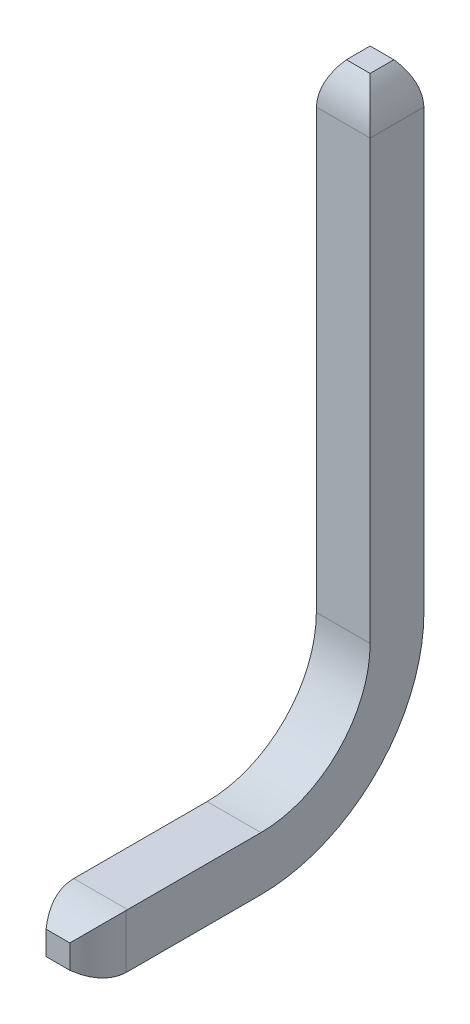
ISO-10303-21;
HEADER;
FILE_DESCRIPTION(('STEP AP214'),'2;1');
FILE_NAME('part.step','',(''),(''),'','','');
FILE_SCHEMA(('AUTOMOTIVE_DESIGN { 1 0 10303 214 1 1 1 1 }'));
ENDSEC;
DATA;
#1=APPLICATION_CONTEXT('core data for automotive mechanical design processes');
#2=APPLICATION_PROTOCOL_DEFINITION('international standard','automotive_design',2000,#1);
#3=PRODUCT_CONTEXT('',#1,'mechanical');
#4=PRODUCT('Part','Part','',(#3));
#5=PRODUCT_RELATED_PRODUCT_CATEGORY('part','',(#4));
#6=PRODUCT_DEFINITION_FORMATION('','',#4);
#7=PRODUCT_DEFINITION_CONTEXT('part definition',#1,'design');
#8=PRODUCT_DEFINITION('design','',#6,#7);
#9=PRODUCT_DEFINITION_SHAPE('','',#8);
#10=(LENGTH_UNIT() NAMED_UNIT(*) SI_UNIT(.MILLI.,.METRE.));
#11=(NAMED_UNIT(*) PLANE_ANGLE_UNIT() SI_UNIT($,.RADIAN.));
#12=(NAMED_UNIT(*) SI_UNIT($,.STERADIAN.) SOLID_ANGLE_UNIT());
#13=UNCERTAINTY_MEASURE_WITH_UNIT(LENGTH_MEASURE(1.E-05),#10,'distance_accuracy_value','');
#14=(GEOMETRIC_REPRESENTATION_CONTEXT(3) GLOBAL_UNCERTAINTY_ASSIGNED_CONTEXT((#13)) GLOBAL_UNIT_ASSIGNED_CONTEXT((#10,
#11,#12)) REPRESENTATION_CONTEXT('',''));
#15=CARTESIAN_POINT('',(0.,0.,0.));
#16=DIRECTION('',(0.,0.,1.));
#17=DIRECTION('',(1.,0.,0.));
#18=AXIS2_PLACEMENT_3D('',#15,#16,#17);
#19=CARTESIAN_POINT('',(0.384591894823,0.144833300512,2.506287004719));
#20=DIRECTION('',(0.,-1.,0.));
#21=DIRECTION('',(0.,0.,-1.));
#22=AXIS2_PLACEMENT_3D('',#19,#20,#21);
#23=CYLINDRICAL_SURFACE('',#22,0.635);
#24=CARTESIAN_POINT('',(-0.250190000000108,0.144622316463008,2.522928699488));
#25=CARTESIAN_POINT('',(-0.24981277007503,0.144251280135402,2.53739312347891));
#26=CARTESIAN_POINT('',(-0.248937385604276,0.143382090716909,2.55182184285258));
#27=CARTESIAN_POINT('',(-0.246222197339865,0.140679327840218,2.58048452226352));
#28=CARTESIAN_POINT('',(-0.244383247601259,0.138846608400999,2.59471864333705));
#29=CARTESIAN_POINT('',(-0.237513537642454,0.131995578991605,2.63669503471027));
#30=CARTESIAN_POINT('',(-0.231120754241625,0.125615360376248,2.66401099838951));
#31=CARTESIAN_POINT('',(-0.215201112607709,0.109721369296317,2.7165928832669));
#32=CARTESIAN_POINT('',(-0.205684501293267,0.100217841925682,2.74186517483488));
#33=CARTESIAN_POINT('',(-0.184043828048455,0.0786043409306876,2.79015344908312));
#34=CARTESIAN_POINT('',(-0.171912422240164,0.0664870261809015,2.8131628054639));
#35=CARTESIAN_POINT('',(-0.15129887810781,0.0458967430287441,2.8472483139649));
#36=CARTESIAN_POINT('',(-0.143507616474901,0.0381141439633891,2.85918161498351));
#37=CARTESIAN_POINT('',(-0.127388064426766,0.0220124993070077,2.88218228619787));
#38=CARTESIAN_POINT('',(-0.119062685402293,0.0136963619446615,2.89325372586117));
#39=CARTESIAN_POINT('',(-0.110489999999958,0.00513330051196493,2.90392869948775));
#40=B_SPLINE_CURVE_WITH_KNOTS('',3,(#24,#25,#26,#27,#28,#29,#30,#31,#32,#33,#34,#35,#36,#37,#38,
#39),.UNSPECIFIED.,.F.,.F.,(4,2,2,2,2,2,2,4),(0.,0.0433870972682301,0.0867358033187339,
0.172547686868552,0.258080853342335,0.343857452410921,0.392536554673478,0.440969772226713),.UNSPECIFIED.);
#41=CARTESIAN_POINT('',(-0.250189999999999,0.144622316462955,2.52292869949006));
#42=VERTEX_POINT('',#41);
#43=CARTESIAN_POINT('',(-0.110489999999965,0.00513330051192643,2.9039286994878));
#44=VERTEX_POINT('',#43);
#45=EDGE_CURVE('E136',#42,#44,#40,.T.);
#46=ORIENTED_EDGE('',*,*,#45,.F.);
#47=DIRECTION('',(0.,1.,0.));
#48=VECTOR('',#47,1.);
#49=CARTESIAN_POINT('',(-0.250189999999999,0.144833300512,2.522928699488));
#50=LINE('',#49,#48);
#51=CARTESIAN_POINT('',(-0.250190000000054,-0.355335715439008,2.522928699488));
#52=VERTEX_POINT('',#51);
#53=EDGE_CURVE('E135',#42,#52,#50,.F.);
#54=ORIENTED_EDGE('',*,*,#53,.T.);
#55=CARTESIAN_POINT('',(-0.110489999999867,-0.215846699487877,2.9039286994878));
#56=CARTESIAN_POINT('',(-0.127635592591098,-0.23297308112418,2.88259789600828));
#57=CARTESIAN_POINT('',(-0.143837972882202,-0.249157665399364,2.85958018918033));
#58=CARTESIAN_POINT('',(-0.173789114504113,-0.279074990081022,2.81006473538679));
#59=CARTESIAN_POINT('',(-0.187504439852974,-0.292774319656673,2.78352684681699));
#60=CARTESIAN_POINT('',(-0.211535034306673,-0.316773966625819,2.72719819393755));
#61=CARTESIAN_POINT('',(-0.221823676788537,-0.327047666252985,2.69738424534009));
#62=CARTESIAN_POINT('',(-0.237911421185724,-0.34310624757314,2.6355934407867));
#63=CARTESIAN_POINT('',(-0.243743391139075,-0.348923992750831,2.60363434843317));
#64=CARTESIAN_POINT('',(-0.247902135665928,-0.353065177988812,2.56322667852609));
#65=CARTESIAN_POINT('',(-0.248573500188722,-0.353733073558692,2.5551965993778));
#66=CARTESIAN_POINT('',(-0.249611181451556,-0.354763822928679,2.5390912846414));
#67=CARTESIAN_POINT('',(-0.24997727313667,-0.355126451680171,2.53101602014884));
#68=CARTESIAN_POINT('',(-0.250190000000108,-0.355335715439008,2.522928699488));
#69=B_SPLINE_CURVE_WITH_KNOTS('',3,(#55,#56,#57,#58,#59,#60,#61,#62,#63,#64,#65,#66,#67,#68),
.UNSPECIFIED.,.F.,.F.,(4,2,2,2,2,2,4),(0.,0.0969606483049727,0.195141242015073,
0.294067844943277,0.392257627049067,0.416507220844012,0.440774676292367),.UNSPECIFIED.);
#70=CARTESIAN_POINT('',(-0.110489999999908,-0.215846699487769,2.90392869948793));
#71=VERTEX_POINT('',#70);
#72=EDGE_CURVE('E21',#71,#52,#69,.T.);
#73=ORIENTED_EDGE('',*,*,#72,.F.);
#74=DIRECTION('',(0.,-1.,0.));
#75=VECTOR('',#74,1.);
#76=CARTESIAN_POINT('',(-0.11049,0.144833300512,2.903928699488));
#77=LINE('',#76,#75);
#78=EDGE_CURVE('E120',#44,#71,#77,.T.);
#79=ORIENTED_EDGE('',*,*,#78,.F.);
#80=EDGE_LOOP('',(#46,#54,#73,#79));
#81=FACE_BOUND('',#80,.T.);
#82=ADVANCED_FACE('F17',(#81),#23,.T.);
#83=CARTESIAN_POINT('',(0.25019,0.144833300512,2.903928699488));
#84=DIRECTION('',(0.,0.,1.));
#85=DIRECTION('',(0.,-1.,0.));
#86=AXIS2_PLACEMENT_3D('',#83,#84,#85);
#87=PLANE('',#86);
#88=DIRECTION('',(1.,0.,0.));
#89=VECTOR('',#88,1.);
#90=CARTESIAN_POINT('',(-0.25019,0.00513330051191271,2.90392869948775));
#91=LINE('',#90,#89);
#92=CARTESIAN_POINT('',(0.110489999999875,0.00513330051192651,2.90392869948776));
#93=VERTEX_POINT('',#92);
#94=EDGE_CURVE('E157',#44,#93,#91,.T.);
#95=ORIENTED_EDGE('',*,*,#94,.F.);
#96=ORIENTED_EDGE('',*,*,#78,.T.);
#97=DIRECTION('',(1.,0.,0.));
#98=VECTOR('',#97,1.);
#99=CARTESIAN_POINT('',(-0.25019,-0.215846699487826,2.90392869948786));
#100=LINE('',#99,#98);
#101=CARTESIAN_POINT('',(0.110489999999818,-0.215846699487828,2.90392869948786));
#102=VERTEX_POINT('',#101);
#103=EDGE_CURVE('E132',#102,#71,#100,.F.);
#104=ORIENTED_EDGE('',*,*,#103,.F.);
#105=DIRECTION('',(0.,-1.,0.));
#106=VECTOR('',#105,1.);
#107=CARTESIAN_POINT('',(0.110489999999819,0.144833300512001,2.90392869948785));
#108=LINE('',#107,#106);
#109=EDGE_CURVE('E180',#93,#102,#108,.T.);
#110=ORIENTED_EDGE('',*,*,#109,.F.);
#111=EDGE_LOOP('',(#95,#96,#104,#110));
#112=FACE_BOUND('',#111,.T.);
#113=ADVANCED_FACE('F294',(#112),#87,.T.);
#114=CARTESIAN_POINT('',(-0.25019,0.279453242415,2.506558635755));
#115=DIRECTION('',(1.,0.,0.));
#116=DIRECTION('',(0.,0.,-1.));
#117=AXIS2_PLACEMENT_3D('',#114,#115,#116);
#118=CYLINDRICAL_SURFACE('',#117,0.635);
#119=CARTESIAN_POINT('',(-0.25019,0.279453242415,2.506558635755));
#120=DIRECTION('',(1.,0.,0.));
#121=DIRECTION('',(0.,0.,-1.));
#122=AXIS2_PLACEMENT_3D('',#119,#120,#121);
#123=CIRCLE('',#122,0.635);
#124=CARTESIAN_POINT('',(-0.25019,-0.355546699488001,2.506558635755));
#125=VERTEX_POINT('',#124);
#126=EDGE_CURVE('E129',#52,#125,#123,.T.);
#127=ORIENTED_EDGE('',*,*,#126,.T.);
#128=DIRECTION('',(1.,0.,0.));
#129=VECTOR('',#128,1.);
#130=CARTESIAN_POINT('',(-0.25019,-0.355546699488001,2.506558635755));
#131=LINE('',#130,#129);
#132=CARTESIAN_POINT('',(0.250190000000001,-0.355546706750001,2.506558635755));
#133=VERTEX_POINT('',#132);
#134=EDGE_CURVE('E217',#133,#125,#131,.F.);
#135=ORIENTED_EDGE('',*,*,#134,.F.);
#136=CARTESIAN_POINT('',(0.250190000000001,0.279453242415,2.506558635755));
#137=DIRECTION('',(1.,0.,0.));
#138=DIRECTION('',(0.,0.,-1.));
#139=AXIS2_PLACEMENT_3D('',#136,#137,#138);
#140=CIRCLE('',#139,0.635);
#141=CARTESIAN_POINT('',(0.250190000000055,-0.355335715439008,2.522928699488));
#142=VERTEX_POINT('',#141);
#143=EDGE_CURVE('E184',#142,#133,#140,.T.);
#144=ORIENTED_EDGE('',*,*,#143,.F.);
#145=CARTESIAN_POINT('',(0.110489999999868,-0.215846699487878,2.9039286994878));
#146=CARTESIAN_POINT('',(0.127635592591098,-0.23297308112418,2.88259789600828));
#147=CARTESIAN_POINT('',(0.143837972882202,-0.249157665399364,2.85958018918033));
#148=CARTESIAN_POINT('',(0.173789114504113,-0.279074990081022,2.81006473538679));
#149=CARTESIAN_POINT('',(0.187504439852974,-0.292774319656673,2.78352684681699));
#150=CARTESIAN_POINT('',(0.211535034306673,-0.316773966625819,2.72719819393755));
#151=CARTESIAN_POINT('',(0.221823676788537,-0.327047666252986,2.69738424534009));
#152=CARTESIAN_POINT('',(0.237911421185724,-0.34310624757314,2.6355934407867));
#153=CARTESIAN_POINT('',(0.243743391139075,-0.348923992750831,2.60363434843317));
#154=CARTESIAN_POINT('',(0.247902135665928,-0.353065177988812,2.56322667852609));
#155=CARTESIAN_POINT('',(0.248573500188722,-0.353733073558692,2.5551965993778));
#156=CARTESIAN_POINT('',(0.249611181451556,-0.354763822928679,2.5390912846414));
#157=CARTESIAN_POINT('',(0.24997727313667,-0.355126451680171,2.53101602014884));
#158=CARTESIAN_POINT('',(0.250190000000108,-0.355335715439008,2.522928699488));
#159=B_SPLINE_CURVE_WITH_KNOTS('',3,(#145,#146,#147,#148,#149,#150,#151,#152,#153,#154,#155,
#156,#157,#158),.UNSPECIFIED.,.F.,.F.,(4,2,2,2,2,2,4),(0.,0.0969606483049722,0.195141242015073,
0.294067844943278,0.392257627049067,0.416507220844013,0.440774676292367),.UNSPECIFIED.);
#160=EDGE_CURVE('E158',#102,#142,#159,.T.);
#161=ORIENTED_EDGE('',*,*,#160,.F.);
#162=ORIENTED_EDGE('',*,*,#103,.T.);
#163=ORIENTED_EDGE('',*,*,#72,.T.);
#164=EDGE_LOOP('',(#127,#135,#144,#161,#162,#163));
#165=FACE_BOUND('',#164,.T.);
#166=ADVANCED_FACE('F126',(#165),#118,.T.);
#167=CARTESIAN_POINT('',(-0.25019,0.144833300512,2.903928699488));
#168=DIRECTION('',(0.,-1.,0.));
#169=DIRECTION('',(0.,0.,-1.));
#170=AXIS2_PLACEMENT_3D('',#167,#168,#169);
#171=PLANE('',#170);
#172=DIRECTION('',(1.,0.,0.));
#173=VECTOR('',#172,1.);
#174=CARTESIAN_POINT('',(-0.25019,0.144833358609,2.506558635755));
#175=LINE('',#174,#173);
#176=CARTESIAN_POINT('',(0.250190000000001,0.1448333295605,2.506558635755));
#177=VERTEX_POINT('',#176);
#178=CARTESIAN_POINT('',(-0.25019,0.144833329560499,2.506558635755));
#179=VERTEX_POINT('',#178);
#180=EDGE_CURVE('E147',#177,#179,#175,.F.);
#181=ORIENTED_EDGE('',*,*,#180,.F.);
#182=DIRECTION('',(0.,0.,-1.));
#183=VECTOR('',#182,1.);
#184=CARTESIAN_POINT('',(0.25019,0.144833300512,-5.175303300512));
#185=LINE('',#184,#183);
#186=CARTESIAN_POINT('',(0.250190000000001,0.144833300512,1.26619));
#187=VERTEX_POINT('',#186);
#188=EDGE_CURVE('E191',#187,#177,#185,.F.);
#189=ORIENTED_EDGE('',*,*,#188,.F.);
#190=DIRECTION('',(1.,0.,0.));
#191=VECTOR('',#190,1.);
#192=CARTESIAN_POINT('',(-8.360353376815,0.144833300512,1.26619));
#193=LINE('',#192,#191);
#194=CARTESIAN_POINT('',(-0.25019,0.144833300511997,1.26619));
#195=VERTEX_POINT('',#194);
#196=EDGE_CURVE('E185',#187,#195,#193,.F.);
#197=ORIENTED_EDGE('',*,*,#196,.T.);
#198=DIRECTION('',(0.,0.,-1.));
#199=VECTOR('',#198,1.);
#200=CARTESIAN_POINT('',(-0.25019,0.144833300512,2.903928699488));
#201=LINE('',#200,#199);
#202=EDGE_CURVE('E146',#179,#195,#201,.T.);
#203=ORIENTED_EDGE('',*,*,#202,.F.);
#204=EDGE_LOOP('',(#181,#189,#197,#203));
#205=FACE_BOUND('',#204,.T.);
#206=ADVANCED_FACE('F169',(#205),#171,.F.);
#207=CARTESIAN_POINT('',(-0.25019,-0.490166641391,2.506558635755));
#208=DIRECTION('',(1.,0.,0.));
#209=DIRECTION('',(0.,0.,-1.));
#210=AXIS2_PLACEMENT_3D('',#207,#208,#209);
#211=CYLINDRICAL_SURFACE('',#210,0.635);
#212=CARTESIAN_POINT('',(0.250190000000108,0.144622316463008,2.522928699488));
#213=CARTESIAN_POINT('',(0.24981277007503,0.144251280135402,2.53739312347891));
#214=CARTESIAN_POINT('',(0.248937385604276,0.143382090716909,2.55182184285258));
#215=CARTESIAN_POINT('',(0.246222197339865,0.140679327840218,2.58048452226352));
#216=CARTESIAN_POINT('',(0.244383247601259,0.138846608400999,2.59471864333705));
#217=CARTESIAN_POINT('',(0.237513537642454,0.131995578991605,2.63669503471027));
#218=CARTESIAN_POINT('',(0.231120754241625,0.125615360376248,2.66401099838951));
#219=CARTESIAN_POINT('',(0.215201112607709,0.109721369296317,2.7165928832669));
#220=CARTESIAN_POINT('',(0.205684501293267,0.100217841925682,2.74186517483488));
#221=CARTESIAN_POINT('',(0.184043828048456,0.0786043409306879,2.79015344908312));
#222=CARTESIAN_POINT('',(0.171912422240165,0.0664870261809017,2.8131628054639));
#223=CARTESIAN_POINT('',(0.15129887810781,0.0458967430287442,2.8472483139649));
#224=CARTESIAN_POINT('',(0.143507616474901,0.0381141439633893,2.85918161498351));
#225=CARTESIAN_POINT('',(0.127388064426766,0.0220124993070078,2.88218228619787));
#226=CARTESIAN_POINT('',(0.119062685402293,0.0136963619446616,2.89325372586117));
#227=CARTESIAN_POINT('',(0.110489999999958,0.00513330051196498,2.90392869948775));
#228=B_SPLINE_CURVE_WITH_KNOTS('',3,(#212,#213,#214,#215,#216,#217,#218,#219,#220,#221,#222,
#223,#224,#225,#226,#227),.UNSPECIFIED.,.F.,.F.,(4,2,2,2,2,2,2,4),(0.,0.0433870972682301,
0.0867358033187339,0.172547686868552,0.258080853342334,0.343857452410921,0.392536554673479,
0.440969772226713),.UNSPECIFIED.);
#229=CARTESIAN_POINT('',(0.250190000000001,0.144622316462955,2.52292869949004));
#230=VERTEX_POINT('',#229);
#231=EDGE_CURVE('E174',#230,#93,#228,.T.);
#232=ORIENTED_EDGE('',*,*,#231,.F.);
#233=CARTESIAN_POINT('',(0.250190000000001,-0.490166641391,2.506558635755));
#234=DIRECTION('',(1.,0.,0.));
#235=DIRECTION('',(0.,0.,-1.));
#236=AXIS2_PLACEMENT_3D('',#233,#234,#235);
#237=CIRCLE('',#236,0.635);
#238=EDGE_CURVE('E188',#177,#230,#237,.T.);
#239=ORIENTED_EDGE('',*,*,#238,.F.);
#240=ORIENTED_EDGE('',*,*,#180,.T.);
#241=CARTESIAN_POINT('',(-0.25019,-0.490166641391,2.506558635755));
#242=DIRECTION('',(1.,0.,0.));
#243=DIRECTION('',(0.,0.,-1.));
#244=AXIS2_PLACEMENT_3D('',#241,#242,#243);
#245=CIRCLE('',#244,0.635);
#246=EDGE_CURVE('E150',#179,#42,#245,.T.);
#247=ORIENTED_EDGE('',*,*,#246,.T.);
#248=ORIENTED_EDGE('',*,*,#45,.T.);
#249=ORIENTED_EDGE('',*,*,#94,.T.);
#250=EDGE_LOOP('',(#232,#239,#240,#247,#248,#249));
#251=FACE_BOUND('',#250,.T.);
#252=ADVANCED_FACE('F164',(#251),#211,.T.);
#253=CARTESIAN_POINT('',(-0.384591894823,0.144833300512,2.506287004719));
#254=DIRECTION('',(0.,-1.,0.));
#255=DIRECTION('',(0.,0.,-1.));
#256=AXIS2_PLACEMENT_3D('',#253,#254,#255);
#257=CYLINDRICAL_SURFACE('',#256,0.635);
#258=ORIENTED_EDGE('',*,*,#231,.T.);
#259=ORIENTED_EDGE('',*,*,#109,.T.);
#260=ORIENTED_EDGE('',*,*,#160,.T.);
#261=DIRECTION('',(0.,1.,0.));
#262=VECTOR('',#261,1.);
#263=CARTESIAN_POINT('',(0.250190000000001,0.144833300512,2.522928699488));
#264=LINE('',#263,#262);
#265=EDGE_CURVE('E190',#230,#142,#264,.F.);
#266=ORIENTED_EDGE('',*,*,#265,.F.);
#267=EDGE_LOOP('',(#258,#259,#260,#266));
#268=FACE_BOUND('',#267,.T.);
#269=ADVANCED_FACE('F168',(#268),#257,.T.);
#270=CARTESIAN_POINT('',(-0.25019,-0.355546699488,2.903928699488));
#271=DIRECTION('',(0.,-1.,0.));
#272=DIRECTION('',(0.,0.,-1.));
#273=AXIS2_PLACEMENT_3D('',#270,#271,#272);
#274=PLANE('',#273);
#275=DIRECTION('',(0.,0.,-1.));
#276=VECTOR('',#275,1.);
#277=CARTESIAN_POINT('',(-0.25019,-0.355546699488,2.903928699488));
#278=LINE('',#277,#276);
#279=CARTESIAN_POINT('',(-0.250190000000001,-0.355546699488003,1.26619));
#280=VERTEX_POINT('',#279);
#281=EDGE_CURVE('E145',#125,#280,#278,.T.);
#282=ORIENTED_EDGE('',*,*,#281,.T.);
#283=DIRECTION('',(1.,0.,0.));
#284=VECTOR('',#283,1.);
#285=CARTESIAN_POINT('',(-8.360353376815,-0.355546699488,1.26619));
#286=LINE('',#285,#284);
#287=CARTESIAN_POINT('',(0.250190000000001,-0.35554670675,1.26619));
#288=VERTEX_POINT('',#287);
#289=EDGE_CURVE('E196',#288,#280,#286,.F.);
#290=ORIENTED_EDGE('',*,*,#289,.F.);
#291=DIRECTION('',(0.,0.,-1.));
#292=VECTOR('',#291,1.);
#293=CARTESIAN_POINT('',(0.25019,-0.355546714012,-5.175303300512));
#294=LINE('',#293,#292);
#295=EDGE_CURVE('E187',#133,#288,#294,.T.);
#296=ORIENTED_EDGE('',*,*,#295,.F.);
#297=ORIENTED_EDGE('',*,*,#134,.T.);
#298=EDGE_LOOP('',(#282,#290,#296,#297));
#299=FACE_BOUND('',#298,.T.);
#300=ADVANCED_FACE('F286',(#299),#274,.T.);
#301=CARTESIAN_POINT('',(-8.360353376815,1.160833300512,1.26619));
#302=DIRECTION('',(1.,0.,0.));
#303=DIRECTION('',(0.,0.,-1.));
#304=AXIS2_PLACEMENT_3D('',#301,#302,#303);
#305=CYLINDRICAL_SURFACE('',#304,1.016);
#306=ORIENTED_EDGE('',*,*,#196,.F.);
#307=CARTESIAN_POINT('',(0.250190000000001,1.160833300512,1.26619));
#308=DIRECTION('',(1.,0.,0.));
#309=DIRECTION('',(0.,0.,-1.));
#310=AXIS2_PLACEMENT_3D('',#307,#308,#309);
#311=CIRCLE('',#310,1.016);
#312=CARTESIAN_POINT('',(0.250190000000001,1.160833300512,0.25019));
#313=VERTEX_POINT('',#312);
#314=EDGE_CURVE('E195',#313,#187,#311,.F.);
#315=ORIENTED_EDGE('',*,*,#314,.F.);
#316=DIRECTION('',(1.,0.,0.));
#317=VECTOR('',#316,1.);
#318=CARTESIAN_POINT('',(-8.360353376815,1.160833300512,0.25019));
#319=LINE('',#318,#317);
#320=CARTESIAN_POINT('',(-0.25019,1.160833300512,0.25019));
#321=VERTEX_POINT('',#320);
#322=EDGE_CURVE('E228',#321,#313,#319,.T.);
#323=ORIENTED_EDGE('',*,*,#322,.F.);
#324=CARTESIAN_POINT('',(-0.250190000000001,1.160833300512,1.26619));
#325=DIRECTION('',(1.,0.,0.));
#326=DIRECTION('',(0.,0.,-1.));
#327=AXIS2_PLACEMENT_3D('',#324,#325,#326);
#328=CIRCLE('',#327,1.016);
#329=EDGE_CURVE('E181',#195,#321,#328,.T.);
#330=ORIENTED_EDGE('',*,*,#329,.F.);
#331=EDGE_LOOP('',(#306,#315,#323,#330));
#332=FACE_BOUND('',#331,.T.);
#333=ADVANCED_FACE('F329',(#332),#305,.F.);
#334=CARTESIAN_POINT('',(-8.360353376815,1.160833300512,1.26619));
#335=DIRECTION('',(1.,0.,0.));
#336=DIRECTION('',(0.,0.,-1.));
#337=AXIS2_PLACEMENT_3D('',#334,#335,#336);
#338=CYLINDRICAL_SURFACE('',#337,1.51638);
#339=ORIENTED_EDGE('',*,*,#289,.T.);
#340=CARTESIAN_POINT('',(-0.250190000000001,1.160833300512,1.26619));
#341=DIRECTION('',(1.,0.,0.));
#342=DIRECTION('',(0.,0.,-1.));
#343=AXIS2_PLACEMENT_3D('',#340,#341,#342);
#344=CIRCLE('',#343,1.51638);
#345=CARTESIAN_POINT('',(-0.25019,1.160833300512,-0.25019));
#346=VERTEX_POINT('',#345);
#347=EDGE_CURVE('E192',#280,#346,#344,.T.);
#348=ORIENTED_EDGE('',*,*,#347,.T.);
#349=DIRECTION('',(1.,0.,0.));
#350=VECTOR('',#349,1.);
#351=CARTESIAN_POINT('',(-8.360353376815,1.160833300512,-0.25019));
#352=LINE('',#351,#350);
#353=CARTESIAN_POINT('',(0.250190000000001,1.160833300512,-0.25019));
#354=VERTEX_POINT('',#353);
#355=EDGE_CURVE('E224',#346,#354,#352,.T.);
#356=ORIENTED_EDGE('',*,*,#355,.T.);
#357=CARTESIAN_POINT('',(0.250190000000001,1.160833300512,1.26619));
#358=DIRECTION('',(1.,0.,0.));
#359=DIRECTION('',(0.,0.,-1.));
#360=AXIS2_PLACEMENT_3D('',#357,#358,#359);
#361=CIRCLE('',#360,1.51638);
#362=EDGE_CURVE('E199',#288,#354,#361,.T.);
#363=ORIENTED_EDGE('',*,*,#362,.F.);
#364=EDGE_LOOP('',(#339,#348,#356,#363));
#365=FACE_BOUND('',#364,.T.);
#366=ADVANCED_FACE('F279',(#365),#338,.T.);
#367=CARTESIAN_POINT('',(-0.384591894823,5.215758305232,-0.25019));
#368=DIRECTION('',(0.,0.,1.));
#369=DIRECTION('',(1.,0.,0.));
#370=AXIS2_PLACEMENT_3D('',#367,#368,#369);
#371=CYLINDRICAL_SURFACE('',#370,0.635);
#372=DIRECTION('',(0.,0.,1.));
#373=VECTOR('',#372,1.);
#374=CARTESIAN_POINT('',(0.11049,5.6134,0.25019));
#375=LINE('',#374,#373);
#376=CARTESIAN_POINT('',(0.110490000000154,5.61340000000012,0.110490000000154));
#377=VERTEX_POINT('',#376);
#378=CARTESIAN_POINT('',(0.110490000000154,5.61340000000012,-0.110490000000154));
#379=VERTEX_POINT('',#378);
#380=EDGE_CURVE('E202',#377,#379,#375,.F.);
#381=ORIENTED_EDGE('',*,*,#380,.F.);
#382=CARTESIAN_POINT('',(-0.384591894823,5.215758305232,-0.384591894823));
#383=DIRECTION('',(0.707106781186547,0.,-0.707106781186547));
#384=DIRECTION('',(0.707106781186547,0.,0.707106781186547));
#385=AXIS2_PLACEMENT_3D('',#382,#383,#384);
#386=ELLIPSE('',#385,0.898025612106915,0.635);
#387=CARTESIAN_POINT('',(0.25019,5.23240000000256,0.25019));
#388=VERTEX_POINT('',#387);
#389=EDGE_CURVE('E205',#388,#377,#386,.F.);
#390=ORIENTED_EDGE('',*,*,#389,.F.);
#391=DIRECTION('',(0.,0.,1.));
#392=VECTOR('',#391,1.);
#393=CARTESIAN_POINT('',(0.25019,5.2324,0.25019));
#394=LINE('',#393,#392);
#395=CARTESIAN_POINT('',(0.25019,5.23240000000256,-0.25019));
#396=VERTEX_POINT('',#395);
#397=EDGE_CURVE('E244',#396,#388,#394,.T.);
#398=ORIENTED_EDGE('',*,*,#397,.F.);
#399=CARTESIAN_POINT('',(-0.384591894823,5.215758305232,0.384591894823));
#400=DIRECTION('',(0.707106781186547,0.,0.707106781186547));
#401=DIRECTION('',(0.707106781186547,0.,-0.707106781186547));
#402=AXIS2_PLACEMENT_3D('',#399,#400,#401);
#403=ELLIPSE('',#402,0.898025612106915,0.635);
#404=EDGE_CURVE('E203',#379,#396,#403,.F.);
#405=ORIENTED_EDGE('',*,*,#404,.F.);
#406=EDGE_LOOP('',(#381,#390,#398,#405));
#407=FACE_BOUND('',#406,.T.);
#408=ADVANCED_FACE('F323',(#407),#371,.T.);
#409=CARTESIAN_POINT('',(-0.25019,5.6134,0.25019));
#410=DIRECTION('',(0.,1.,0.));
#411=DIRECTION('',(0.,0.,1.));
#412=AXIS2_PLACEMENT_3D('',#409,#410,#411);
#413=PLANE('',#412);
#414=DIRECTION('',(1.,0.,0.));
#415=VECTOR('',#414,1.);
#416=CARTESIAN_POINT('',(-0.25019,5.61340000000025,0.110490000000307));
#417=LINE('',#416,#415);
#418=CARTESIAN_POINT('',(-0.110490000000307,5.61340000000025,0.110490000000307));
#419=VERTEX_POINT('',#418);
#420=EDGE_CURVE('E208',#377,#419,#417,.F.);
#421=ORIENTED_EDGE('',*,*,#420,.F.);
#422=ORIENTED_EDGE('',*,*,#380,.T.);
#423=DIRECTION('',(1.,0.,0.));
#424=VECTOR('',#423,1.);
#425=CARTESIAN_POINT('',(-0.25019,5.61340000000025,-0.110490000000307));
#426=LINE('',#425,#424);
#427=CARTESIAN_POINT('',(-0.110490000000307,5.61340000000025,-0.110490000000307));
#428=VERTEX_POINT('',#427);
#429=EDGE_CURVE('E206',#428,#379,#426,.T.);
#430=ORIENTED_EDGE('',*,*,#429,.F.);
#431=DIRECTION('',(0.,0.,1.));
#432=VECTOR('',#431,1.);
#433=CARTESIAN_POINT('',(-0.110490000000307,5.61340000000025,-0.25019));
#434=LINE('',#433,#432);
#435=EDGE_CURVE('E212',#419,#428,#434,.F.);
#436=ORIENTED_EDGE('',*,*,#435,.F.);
#437=EDGE_LOOP('',(#421,#422,#430,#436));
#438=FACE_BOUND('',#437,.T.);
#439=ADVANCED_FACE('F266',(#438),#413,.T.);
#440=CARTESIAN_POINT('',(-0.25019,5.215758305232,0.384591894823));
#441=DIRECTION('',(1.,0.,0.));
#442=DIRECTION('',(0.,0.,-1.));
#443=AXIS2_PLACEMENT_3D('',#440,#441,#442);
#444=CYLINDRICAL_SURFACE('',#443,0.635);
#445=DIRECTION('',(-1.,0.,0.));
#446=VECTOR('',#445,1.);
#447=CARTESIAN_POINT('',(-0.25019,5.2324,-0.25019));
#448=LINE('',#447,#446);
#449=CARTESIAN_POINT('',(-0.25019,5.23240000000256,-0.25019));
#450=VERTEX_POINT('',#449);
#451=EDGE_CURVE('E241',#450,#396,#448,.F.);
#452=ORIENTED_EDGE('',*,*,#451,.F.);
#453=CARTESIAN_POINT('',(0.384591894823,5.215758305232,0.384591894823));
#454=DIRECTION('',(-0.707106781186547,0.,0.707106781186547));
#455=DIRECTION('',(0.707106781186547,0.,0.707106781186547));
#456=AXIS2_PLACEMENT_3D('',#453,#454,#455);
#457=ELLIPSE('',#456,0.898025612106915,0.635);
#458=EDGE_CURVE('E209',#428,#450,#457,.T.);
#459=ORIENTED_EDGE('',*,*,#458,.F.);
#460=ORIENTED_EDGE('',*,*,#429,.T.);
#461=ORIENTED_EDGE('',*,*,#404,.T.);
#462=EDGE_LOOP('',(#452,#459,#460,#461));
#463=FACE_BOUND('',#462,.T.);
#464=ADVANCED_FACE('F270',(#463),#444,.T.);
#465=CARTESIAN_POINT('',(-0.25019,5.215758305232,-0.384591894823));
#466=DIRECTION('',(1.,0.,0.));
#467=DIRECTION('',(0.,0.,-1.));
#468=AXIS2_PLACEMENT_3D('',#465,#466,#467);
#469=CYLINDRICAL_SURFACE('',#468,0.635);
#470=ORIENTED_EDGE('',*,*,#420,.T.);
#471=CARTESIAN_POINT('',(0.384591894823,5.215758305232,-0.384591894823));
#472=DIRECTION('',(0.707106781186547,0.,0.707106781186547));
#473=DIRECTION('',(-0.707106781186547,0.,0.707106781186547));
#474=AXIS2_PLACEMENT_3D('',#471,#472,#473);
#475=ELLIPSE('',#474,0.898025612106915,0.635);
#476=CARTESIAN_POINT('',(-0.25019,5.23240000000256,0.25019));
#477=VERTEX_POINT('',#476);
#478=EDGE_CURVE('E211',#477,#419,#475,.F.);
#479=ORIENTED_EDGE('',*,*,#478,.F.);
#480=DIRECTION('',(-1.,0.,0.));
#481=VECTOR('',#480,1.);
#482=CARTESIAN_POINT('',(-0.25019,5.2324,0.25019));
#483=LINE('',#482,#481);
#484=EDGE_CURVE('E39',#477,#388,#483,.F.);
#485=ORIENTED_EDGE('',*,*,#484,.T.);
#486=ORIENTED_EDGE('',*,*,#389,.T.);
#487=EDGE_LOOP('',(#470,#479,#485,#486));
#488=FACE_BOUND('',#487,.T.);
#489=ADVANCED_FACE('F315',(#488),#469,.T.);
#490=CARTESIAN_POINT('',(0.25019,5.6134,0.25019));
#491=DIRECTION('',(1.,0.,0.));
#492=DIRECTION('',(0.,1.,0.));
#493=AXIS2_PLACEMENT_3D('',#490,#491,#492);
#494=PLANE('',#493);
#495=DIRECTION('',(0.,1.,0.));
#496=VECTOR('',#495,1.);
#497=CARTESIAN_POINT('',(0.25019,-2.465832,0.25019));
#498=LINE('',#497,#496);
#499=EDGE_CURVE('E246',#388,#313,#498,.F.);
#500=ORIENTED_EDGE('',*,*,#499,.T.);
#501=ORIENTED_EDGE('',*,*,#314,.T.);
#502=ORIENTED_EDGE('',*,*,#188,.T.);
#503=ORIENTED_EDGE('',*,*,#238,.T.);
#504=ORIENTED_EDGE('',*,*,#265,.T.);
#505=ORIENTED_EDGE('',*,*,#143,.T.);
#506=ORIENTED_EDGE('',*,*,#295,.T.);
#507=ORIENTED_EDGE('',*,*,#362,.T.);
#508=DIRECTION('',(0.,1.,0.));
#509=VECTOR('',#508,1.);
#510=CARTESIAN_POINT('',(0.25019,-2.465832,-0.25019));
#511=LINE('',#510,#509);
#512=EDGE_CURVE('E238',#396,#354,#511,.F.);
#513=ORIENTED_EDGE('',*,*,#512,.F.);
#514=ORIENTED_EDGE('',*,*,#397,.T.);
#515=EDGE_LOOP('',(#500,#501,#502,#503,#504,#505,#506,#507,#513,#514));
#516=FACE_BOUND('',#515,.T.);
#517=ADVANCED_FACE('F281',(#516),#494,.T.);
#518=CARTESIAN_POINT('',(-0.25019,-2.465832,-0.25019));
#519=DIRECTION('',(0.,0.,-1.));
#520=DIRECTION('',(-1.,0.,0.));
#521=AXIS2_PLACEMENT_3D('',#518,#519,#520);
#522=PLANE('',#521);
#523=ORIENTED_EDGE('',*,*,#355,.F.);
#524=DIRECTION('',(0.,1.,0.));
#525=VECTOR('',#524,1.);
#526=CARTESIAN_POINT('',(-0.25019,5.6134,-0.25019));
#527=LINE('',#526,#525);
#528=EDGE_CURVE('E249',#346,#450,#527,.T.);
#529=ORIENTED_EDGE('',*,*,#528,.T.);
#530=ORIENTED_EDGE('',*,*,#451,.T.);
#531=ORIENTED_EDGE('',*,*,#512,.T.);
#532=EDGE_LOOP('',(#523,#529,#530,#531));
#533=FACE_BOUND('',#532,.T.);
#534=ADVANCED_FACE('F275',(#533),#522,.T.);
#535=CARTESIAN_POINT('',(0.384591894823,5.215758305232,-0.25019));
#536=DIRECTION('',(0.,0.,1.));
#537=DIRECTION('',(1.,0.,0.));
#538=AXIS2_PLACEMENT_3D('',#535,#536,#537);
#539=CYLINDRICAL_SURFACE('',#538,0.635);
#540=DIRECTION('',(0.,0.,1.));
#541=VECTOR('',#540,1.);
#542=CARTESIAN_POINT('',(-0.25019,5.2324,0.25019));
#543=LINE('',#542,#541);
#544=EDGE_CURVE('E31',#450,#477,#543,.T.);
#545=ORIENTED_EDGE('',*,*,#544,.T.);
#546=ORIENTED_EDGE('',*,*,#478,.T.);
#547=ORIENTED_EDGE('',*,*,#435,.T.);
#548=ORIENTED_EDGE('',*,*,#458,.T.);
#549=EDGE_LOOP('',(#545,#546,#547,#548));
#550=FACE_BOUND('',#549,.T.);
#551=ADVANCED_FACE('F261',(#550),#539,.T.);
#552=CARTESIAN_POINT('',(-0.25019,-2.465832,0.25019));
#553=DIRECTION('',(0.,0.,-1.));
#554=DIRECTION('',(-1.,0.,0.));
#555=AXIS2_PLACEMENT_3D('',#552,#553,#554);
#556=PLANE('',#555);
#557=ORIENTED_EDGE('',*,*,#484,.F.);
#558=DIRECTION('',(0.,1.,0.));
#559=VECTOR('',#558,1.);
#560=CARTESIAN_POINT('',(-0.25019,5.6134,0.25019));
#561=LINE('',#560,#559);
#562=EDGE_CURVE('E11',#477,#321,#561,.F.);
#563=ORIENTED_EDGE('',*,*,#562,.T.);
#564=ORIENTED_EDGE('',*,*,#322,.T.);
#565=ORIENTED_EDGE('',*,*,#499,.F.);
#566=EDGE_LOOP('',(#557,#563,#564,#565));
#567=FACE_BOUND('',#566,.T.);
#568=ADVANCED_FACE('F302',(#567),#556,.F.);
#569=CARTESIAN_POINT('',(-0.25019,5.6134,0.25019));
#570=DIRECTION('',(1.,0.,0.));
#571=DIRECTION('',(0.,1.,0.));
#572=AXIS2_PLACEMENT_3D('',#569,#570,#571);
#573=PLANE('',#572);
#574=ORIENTED_EDGE('',*,*,#544,.F.);
#575=ORIENTED_EDGE('',*,*,#528,.F.);
#576=ORIENTED_EDGE('',*,*,#347,.F.);
#577=ORIENTED_EDGE('',*,*,#281,.F.);
#578=ORIENTED_EDGE('',*,*,#126,.F.);
#579=ORIENTED_EDGE('',*,*,#53,.F.);
#580=ORIENTED_EDGE('',*,*,#246,.F.);
#581=ORIENTED_EDGE('',*,*,#202,.T.);
#582=ORIENTED_EDGE('',*,*,#329,.T.);
#583=ORIENTED_EDGE('',*,*,#562,.F.);
#584=EDGE_LOOP('',(#574,#575,#576,#577,#578,#579,#580,#581,#582,#583));
#585=FACE_BOUND('',#584,.T.);
#586=ADVANCED_FACE('F143',(#585),#573,.F.);
#587=CLOSED_SHELL('',(#82,#113,#166,#206,#252,#269,#300,#333,#366,#408,#439,#464,#489,#517,#534,
#551,#568,#586));
#588=MANIFOLD_SOLID_BREP('B1',#587);
#589=ADVANCED_BREP_SHAPE_REPRESENTATION('',(#18,#588),#14);
#590=SHAPE_DEFINITION_REPRESENTATION(#9,#589);
ENDSEC;
END-ISO-10303-21;
